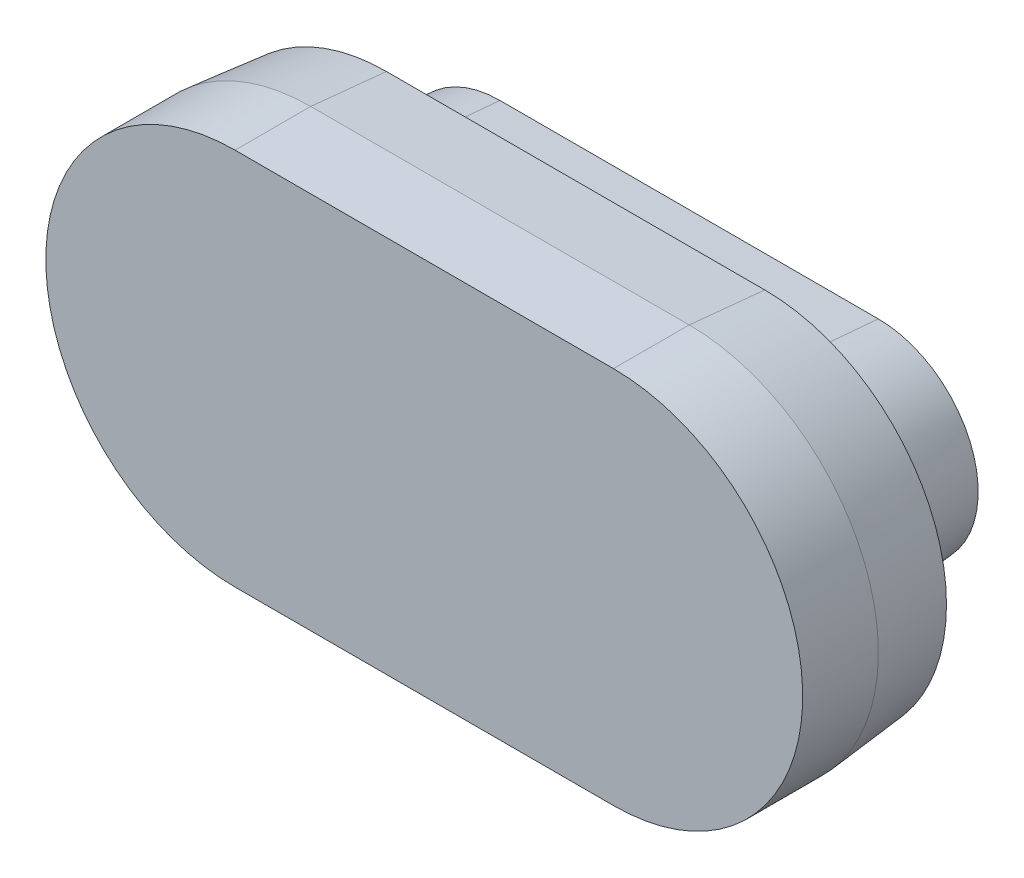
ISO-10303-21;
HEADER;
FILE_DESCRIPTION(('STEP AP214'),'2;1');
FILE_NAME('part.step','',(''),(''),'','','');
FILE_SCHEMA(('AUTOMOTIVE_DESIGN { 1 0 10303 214 1 1 1 1 }'));
ENDSEC;
DATA;
#1=APPLICATION_CONTEXT('core data for automotive mechanical design processes');
#2=APPLICATION_PROTOCOL_DEFINITION('international standard','automotive_design',2000,#1);
#3=PRODUCT_CONTEXT('',#1,'mechanical');
#4=PRODUCT('Part','Part','',(#3));
#5=PRODUCT_RELATED_PRODUCT_CATEGORY('part','',(#4));
#6=PRODUCT_DEFINITION_FORMATION('','',#4);
#7=PRODUCT_DEFINITION_CONTEXT('part definition',#1,'design');
#8=PRODUCT_DEFINITION('design','',#6,#7);
#9=PRODUCT_DEFINITION_SHAPE('','',#8);
#10=(LENGTH_UNIT() NAMED_UNIT(*) SI_UNIT(.MILLI.,.METRE.));
#11=(NAMED_UNIT(*) PLANE_ANGLE_UNIT() SI_UNIT($,.RADIAN.));
#12=(NAMED_UNIT(*) SI_UNIT($,.STERADIAN.) SOLID_ANGLE_UNIT());
#13=UNCERTAINTY_MEASURE_WITH_UNIT(LENGTH_MEASURE(1.E-05),#10,'distance_accuracy_value','');
#14=(GEOMETRIC_REPRESENTATION_CONTEXT(3) GLOBAL_UNCERTAINTY_ASSIGNED_CONTEXT((#13)) GLOBAL_UNIT_ASSIGNED_CONTEXT((#10,
#11,#12)) REPRESENTATION_CONTEXT('',''));
#15=CARTESIAN_POINT('',(0.,0.,0.));
#16=DIRECTION('',(0.,0.,1.));
#17=DIRECTION('',(1.,0.,0.));
#18=AXIS2_PLACEMENT_3D('',#15,#16,#17);
#19=CARTESIAN_POINT('',(0.,0.,0.));
#20=DIRECTION('',(0.,0.,1.));
#21=DIRECTION('',(1.,0.,0.));
#22=AXIS2_PLACEMENT_3D('',#19,#20,#21);
#23=PLANE('',#22);
#24=DIRECTION('',(-1.,0.,0.));
#25=VECTOR('',#24,1.);
#26=CARTESIAN_POINT('',(0.,-2.40000000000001,0.));
#27=LINE('',#26,#25);
#28=CARTESIAN_POINT('',(5.,-2.40000000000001,0.));
#29=VERTEX_POINT('',#28);
#30=CARTESIAN_POINT('',(0.,-2.40000000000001,0.));
#31=VERTEX_POINT('',#30);
#32=EDGE_CURVE('E297',#29,#31,#27,.T.);
#33=ORIENTED_EDGE('',*,*,#32,.T.);
#34=CARTESIAN_POINT('',(0.,0.,0.));
#35=DIRECTION('',(0.,0.,1.));
#36=DIRECTION('',(1.,0.,0.));
#37=AXIS2_PLACEMENT_3D('',#34,#35,#36);
#38=CIRCLE('',#37,2.40000000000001);
#39=CARTESIAN_POINT('',(0.,2.40000000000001,0.));
#40=VERTEX_POINT('',#39);
#41=EDGE_CURVE('E300',#31,#40,#38,.F.);
#42=ORIENTED_EDGE('',*,*,#41,.T.);
#43=DIRECTION('',(1.,0.,0.));
#44=VECTOR('',#43,1.);
#45=CARTESIAN_POINT('',(0.,2.40000000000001,0.));
#46=LINE('',#45,#44);
#47=CARTESIAN_POINT('',(5.,2.40000000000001,0.));
#48=VERTEX_POINT('',#47);
#49=EDGE_CURVE('E294',#40,#48,#46,.T.);
#50=ORIENTED_EDGE('',*,*,#49,.T.);
#51=CARTESIAN_POINT('',(5.,0.,0.));
#52=DIRECTION('',(0.,0.,1.));
#53=DIRECTION('',(1.,0.,0.));
#54=AXIS2_PLACEMENT_3D('',#51,#52,#53);
#55=CIRCLE('',#54,2.40000000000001);
#56=EDGE_CURVE('E291',#48,#29,#55,.F.);
#57=ORIENTED_EDGE('',*,*,#56,.T.);
#58=EDGE_LOOP('',(#33,#42,#50,#57));
#59=FACE_BOUND('',#58,.T.);
#60=CARTESIAN_POINT('',(5.,0.,0.));
#61=DIRECTION('',(0.,0.,-1.));
#62=DIRECTION('',(-1.,0.,0.));
#63=AXIS2_PLACEMENT_3D('',#60,#61,#62);
#64=CIRCLE('',#63,1.45);
#65=CARTESIAN_POINT('',(5.,1.45,0.));
#66=VERTEX_POINT('',#65);
#67=CARTESIAN_POINT('',(5.,-1.45,0.));
#68=VERTEX_POINT('',#67);
#69=EDGE_CURVE('E191',#66,#68,#64,.T.);
#70=ORIENTED_EDGE('',*,*,#69,.F.);
#71=DIRECTION('',(1.,0.,0.));
#72=VECTOR('',#71,1.);
#73=CARTESIAN_POINT('',(5.,1.45,0.));
#74=LINE('',#73,#72);
#75=CARTESIAN_POINT('',(0.,1.45,0.));
#76=VERTEX_POINT('',#75);
#77=EDGE_CURVE('E175',#76,#66,#74,.T.);
#78=ORIENTED_EDGE('',*,*,#77,.F.);
#79=CARTESIAN_POINT('',(0.,0.,0.));
#80=DIRECTION('',(0.,0.,-1.));
#81=DIRECTION('',(1.,0.,0.));
#82=AXIS2_PLACEMENT_3D('',#79,#80,#81);
#83=CIRCLE('',#82,1.45);
#84=CARTESIAN_POINT('',(0.,-1.45,0.));
#85=VERTEX_POINT('',#84);
#86=EDGE_CURVE('E170',#85,#76,#83,.T.);
#87=ORIENTED_EDGE('',*,*,#86,.F.);
#88=DIRECTION('',(-1.,0.,0.));
#89=VECTOR('',#88,1.);
#90=CARTESIAN_POINT('',(5.,-1.45,0.));
#91=LINE('',#90,#89);
#92=EDGE_CURVE('E172',#68,#85,#91,.T.);
#93=ORIENTED_EDGE('',*,*,#92,.F.);
#94=EDGE_LOOP('',(#70,#78,#87,#93));
#95=FACE_BOUND('',#94,.T.);
#96=ADVANCED_FACE('F53',(#59,#95),#23,.F.);
#97=CARTESIAN_POINT('',(0.,0.,2.));
#98=DIRECTION('',(0.,0.,-1.));
#99=DIRECTION('',(-1.,0.,0.));
#100=AXIS2_PLACEMENT_3D('',#97,#98,#99);
#101=CYLINDRICAL_SURFACE('',#100,2.5);
#102=DIRECTION('',(0.,0.,-1.));
#103=VECTOR('',#102,1.);
#104=CARTESIAN_POINT('',(0.,2.5,2.));
#105=LINE('',#104,#103);
#106=CARTESIAN_POINT('',(0.,2.5,2.));
#107=VERTEX_POINT('',#106);
#108=CARTESIAN_POINT('',(0.,2.5,0.999999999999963));
#109=VERTEX_POINT('',#108);
#110=EDGE_CURVE('E342',#107,#109,#105,.T.);
#111=ORIENTED_EDGE('',*,*,#110,.T.);
#112=CARTESIAN_POINT('',(0.,0.,0.999999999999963));
#113=DIRECTION('',(0.,0.,1.));
#114=DIRECTION('',(1.,0.,0.));
#115=AXIS2_PLACEMENT_3D('',#112,#113,#114);
#116=CIRCLE('',#115,2.5);
#117=CARTESIAN_POINT('',(0.,-2.5,0.999999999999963));
#118=VERTEX_POINT('',#117);
#119=EDGE_CURVE('E274',#109,#118,#116,.T.);
#120=ORIENTED_EDGE('',*,*,#119,.T.);
#121=DIRECTION('',(0.,0.,-1.));
#122=VECTOR('',#121,1.);
#123=CARTESIAN_POINT('',(0.,-2.5,2.));
#124=LINE('',#123,#122);
#125=CARTESIAN_POINT('',(0.,-2.5,2.));
#126=VERTEX_POINT('',#125);
#127=EDGE_CURVE('E222',#126,#118,#124,.T.);
#128=ORIENTED_EDGE('',*,*,#127,.F.);
#129=CARTESIAN_POINT('',(0.,0.,2.));
#130=DIRECTION('',(0.,0.,1.));
#131=DIRECTION('',(1.,0.,0.));
#132=AXIS2_PLACEMENT_3D('',#129,#130,#131);
#133=CIRCLE('',#132,2.5);
#134=EDGE_CURVE('E200',#107,#126,#133,.T.);
#135=ORIENTED_EDGE('',*,*,#134,.F.);
#136=EDGE_LOOP('',(#111,#120,#128,#135));
#137=FACE_BOUND('',#136,.T.);
#138=ADVANCED_FACE('F339',(#137),#101,.T.);
#139=CARTESIAN_POINT('',(0.,-2.5,2.));
#140=DIRECTION('',(0.,1.,0.));
#141=DIRECTION('',(0.,0.,1.));
#142=AXIS2_PLACEMENT_3D('',#139,#140,#141);
#143=PLANE('',#142);
#144=ORIENTED_EDGE('',*,*,#127,.T.);
#145=DIRECTION('',(1.,0.,0.));
#146=VECTOR('',#145,1.);
#147=CARTESIAN_POINT('',(0.,-2.5,0.999999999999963));
#148=LINE('',#147,#146);
#149=CARTESIAN_POINT('',(5.,-2.5,0.999999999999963));
#150=VERTEX_POINT('',#149);
#151=EDGE_CURVE('E78',#118,#150,#148,.T.);
#152=ORIENTED_EDGE('',*,*,#151,.T.);
#153=DIRECTION('',(0.,0.,-1.));
#154=VECTOR('',#153,1.);
#155=CARTESIAN_POINT('',(5.,-2.5,2.));
#156=LINE('',#155,#154);
#157=CARTESIAN_POINT('',(5.,-2.5,2.));
#158=VERTEX_POINT('',#157);
#159=EDGE_CURVE('E347',#158,#150,#156,.T.);
#160=ORIENTED_EDGE('',*,*,#159,.F.);
#161=DIRECTION('',(1.,0.,0.));
#162=VECTOR('',#161,1.);
#163=CARTESIAN_POINT('',(0.,-2.5,2.));
#164=LINE('',#163,#162);
#165=EDGE_CURVE('E344',#126,#158,#164,.T.);
#166=ORIENTED_EDGE('',*,*,#165,.F.);
#167=EDGE_LOOP('',(#144,#152,#160,#166));
#168=FACE_BOUND('',#167,.T.);
#169=ADVANCED_FACE('F343',(#168),#143,.F.);
#170=CARTESIAN_POINT('',(5.,0.,2.));
#171=DIRECTION('',(0.,0.,-1.));
#172=DIRECTION('',(-1.,0.,0.));
#173=AXIS2_PLACEMENT_3D('',#170,#171,#172);
#174=CYLINDRICAL_SURFACE('',#173,2.5);
#175=ORIENTED_EDGE('',*,*,#159,.T.);
#176=CARTESIAN_POINT('',(5.,0.,0.999999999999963));
#177=DIRECTION('',(0.,0.,1.));
#178=DIRECTION('',(1.,0.,0.));
#179=AXIS2_PLACEMENT_3D('',#176,#177,#178);
#180=CIRCLE('',#179,2.5);
#181=CARTESIAN_POINT('',(5.,2.5,0.999999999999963));
#182=VERTEX_POINT('',#181);
#183=EDGE_CURVE('E11',#150,#182,#180,.T.);
#184=ORIENTED_EDGE('',*,*,#183,.T.);
#185=DIRECTION('',(0.,0.,-1.));
#186=VECTOR('',#185,1.);
#187=CARTESIAN_POINT('',(5.,2.5,2.));
#188=LINE('',#187,#186);
#189=CARTESIAN_POINT('',(5.,2.5,2.));
#190=VERTEX_POINT('',#189);
#191=EDGE_CURVE('E350',#190,#182,#188,.T.);
#192=ORIENTED_EDGE('',*,*,#191,.F.);
#193=CARTESIAN_POINT('',(5.,0.,2.));
#194=DIRECTION('',(0.,0.,1.));
#195=DIRECTION('',(1.,0.,0.));
#196=AXIS2_PLACEMENT_3D('',#193,#194,#195);
#197=CIRCLE('',#196,2.5);
#198=EDGE_CURVE('E372',#158,#190,#197,.T.);
#199=ORIENTED_EDGE('',*,*,#198,.F.);
#200=EDGE_LOOP('',(#175,#184,#192,#199));
#201=FACE_BOUND('',#200,.T.);
#202=ADVANCED_FACE('F384',(#201),#174,.T.);
#203=CARTESIAN_POINT('',(0.,2.5,2.));
#204=DIRECTION('',(0.,-1.,0.));
#205=DIRECTION('',(0.,0.,-1.));
#206=AXIS2_PLACEMENT_3D('',#203,#204,#205);
#207=PLANE('',#206);
#208=ORIENTED_EDGE('',*,*,#191,.T.);
#209=DIRECTION('',(-1.,0.,0.));
#210=VECTOR('',#209,1.);
#211=CARTESIAN_POINT('',(0.,2.5,0.999999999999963));
#212=LINE('',#211,#210);
#213=EDGE_CURVE('E64',#182,#109,#212,.T.);
#214=ORIENTED_EDGE('',*,*,#213,.T.);
#215=ORIENTED_EDGE('',*,*,#110,.F.);
#216=DIRECTION('',(-1.,0.,0.));
#217=VECTOR('',#216,1.);
#218=CARTESIAN_POINT('',(0.,2.5,2.));
#219=LINE('',#218,#217);
#220=EDGE_CURVE('E375',#190,#107,#219,.T.);
#221=ORIENTED_EDGE('',*,*,#220,.F.);
#222=EDGE_LOOP('',(#208,#214,#215,#221));
#223=FACE_BOUND('',#222,.T.);
#224=ADVANCED_FACE('F382',(#223),#207,.F.);
#225=CARTESIAN_POINT('',(0.,0.,2.));
#226=DIRECTION('',(0.,0.,1.));
#227=DIRECTION('',(1.,0.,0.));
#228=AXIS2_PLACEMENT_3D('',#225,#226,#227);
#229=PLANE('',#228);
#230=ORIENTED_EDGE('',*,*,#134,.T.);
#231=ORIENTED_EDGE('',*,*,#165,.T.);
#232=ORIENTED_EDGE('',*,*,#198,.T.);
#233=ORIENTED_EDGE('',*,*,#220,.T.);
#234=EDGE_LOOP('',(#230,#231,#232,#233));
#235=FACE_BOUND('',#234,.T.);
#236=ADVANCED_FACE('F386',(#235),#229,.T.);
#237=CARTESIAN_POINT('',(5.,0.,0.));
#238=DIRECTION('',(0.,0.,1.));
#239=DIRECTION('',(-1.,0.,0.));
#240=AXIS2_PLACEMENT_3D('',#237,#238,#239);
#241=CONICAL_SURFACE('',#240,1.45,0.0872664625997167);
#242=ORIENTED_EDGE('',*,*,#69,.T.);
#243=DIRECTION('',(0.,-0.0871557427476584,0.996194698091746));
#244=VECTOR('',#243,1.);
#245=CARTESIAN_POINT('',(5.,-1.43898562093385,-0.125894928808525));
#246=LINE('',#245,#244);
#247=CARTESIAN_POINT('',(5.,-1.31876700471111,-1.5));
#248=VERTEX_POINT('',#247);
#249=EDGE_CURVE('E188',#248,#68,#246,.T.);
#250=ORIENTED_EDGE('',*,*,#249,.F.);
#251=CARTESIAN_POINT('',(5.,0.,-1.5));
#252=DIRECTION('',(0.,0.,-1.));
#253=DIRECTION('',(-1.,0.,0.));
#254=AXIS2_PLACEMENT_3D('',#251,#252,#253);
#255=CIRCLE('',#254,1.31876700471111);
#256=CARTESIAN_POINT('',(5.,1.31876700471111,-1.5));
#257=VERTEX_POINT('',#256);
#258=EDGE_CURVE('E214',#257,#248,#255,.T.);
#259=ORIENTED_EDGE('',*,*,#258,.F.);
#260=DIRECTION('',(0.,0.0871557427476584,0.996194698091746));
#261=VECTOR('',#260,1.);
#262=CARTESIAN_POINT('',(5.,1.43898562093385,-0.125894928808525));
#263=LINE('',#262,#261);
#264=EDGE_CURVE('E202',#257,#66,#263,.T.);
#265=ORIENTED_EDGE('',*,*,#264,.T.);
#266=EDGE_LOOP('',(#242,#250,#259,#265));
#267=FACE_BOUND('',#266,.T.);
#268=ADVANCED_FACE('F362',(#267),#241,.T.);
#269=CARTESIAN_POINT('',(5.,-1.45,0.));
#270=DIRECTION('',(0.,-0.996194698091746,-0.0871557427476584));
#271=DIRECTION('',(0.,0.0871557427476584,-0.996194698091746));
#272=AXIS2_PLACEMENT_3D('',#269,#270,#271);
#273=PLANE('',#272);
#274=ORIENTED_EDGE('',*,*,#92,.T.);
#275=DIRECTION('',(0.,-0.0871557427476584,0.996194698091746));
#276=VECTOR('',#275,1.);
#277=CARTESIAN_POINT('',(0.,-1.43898562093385,-0.125894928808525));
#278=LINE('',#277,#276);
#279=CARTESIAN_POINT('',(0.,-1.31876700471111,-1.5));
#280=VERTEX_POINT('',#279);
#281=EDGE_CURVE('E185',#280,#85,#278,.T.);
#282=ORIENTED_EDGE('',*,*,#281,.F.);
#283=DIRECTION('',(1.,0.,0.));
#284=VECTOR('',#283,1.);
#285=CARTESIAN_POINT('',(5.,-1.31876700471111,-1.5));
#286=LINE('',#285,#284);
#287=EDGE_CURVE('E206',#248,#280,#286,.F.);
#288=ORIENTED_EDGE('',*,*,#287,.F.);
#289=ORIENTED_EDGE('',*,*,#249,.T.);
#290=EDGE_LOOP('',(#274,#282,#288,#289));
#291=FACE_BOUND('',#290,.T.);
#292=ADVANCED_FACE('F184',(#291),#273,.T.);
#293=CARTESIAN_POINT('',(0.,0.,0.));
#294=DIRECTION('',(0.,0.,1.));
#295=DIRECTION('',(1.,0.,0.));
#296=AXIS2_PLACEMENT_3D('',#293,#294,#295);
#297=CONICAL_SURFACE('',#296,1.45,0.0872664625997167);
#298=ORIENTED_EDGE('',*,*,#86,.T.);
#299=DIRECTION('',(0.,0.0871557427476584,0.996194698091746));
#300=VECTOR('',#299,1.);
#301=CARTESIAN_POINT('',(0.,1.43898562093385,-0.125894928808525));
#302=LINE('',#301,#300);
#303=CARTESIAN_POINT('',(0.,1.31876700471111,-1.5));
#304=VERTEX_POINT('',#303);
#305=EDGE_CURVE('E196',#304,#76,#302,.T.);
#306=ORIENTED_EDGE('',*,*,#305,.F.);
#307=CARTESIAN_POINT('',(0.,0.,-1.5));
#308=DIRECTION('',(0.,0.,-1.));
#309=DIRECTION('',(-1.,0.,0.));
#310=AXIS2_PLACEMENT_3D('',#307,#308,#309);
#311=CIRCLE('',#310,1.31876700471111);
#312=EDGE_CURVE('E194',#280,#304,#311,.T.);
#313=ORIENTED_EDGE('',*,*,#312,.F.);
#314=ORIENTED_EDGE('',*,*,#281,.T.);
#315=EDGE_LOOP('',(#298,#306,#313,#314));
#316=FACE_BOUND('',#315,.T.);
#317=ADVANCED_FACE('F193',(#316),#297,.T.);
#318=CARTESIAN_POINT('',(5.,1.45,0.));
#319=DIRECTION('',(0.,0.996194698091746,-0.0871557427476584));
#320=DIRECTION('',(0.,0.0871557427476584,0.996194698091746));
#321=AXIS2_PLACEMENT_3D('',#318,#319,#320);
#322=PLANE('',#321);
#323=ORIENTED_EDGE('',*,*,#77,.T.);
#324=ORIENTED_EDGE('',*,*,#264,.F.);
#325=DIRECTION('',(-1.,0.,0.));
#326=VECTOR('',#325,1.);
#327=CARTESIAN_POINT('',(5.,1.31876700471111,-1.5));
#328=LINE('',#327,#326);
#329=EDGE_CURVE('E209',#304,#257,#328,.F.);
#330=ORIENTED_EDGE('',*,*,#329,.F.);
#331=ORIENTED_EDGE('',*,*,#305,.T.);
#332=EDGE_LOOP('',(#323,#324,#330,#331));
#333=FACE_BOUND('',#332,.T.);
#334=ADVANCED_FACE('F360',(#333),#322,.T.);
#335=CARTESIAN_POINT('',(5.,0.,-1.5));
#336=DIRECTION('',(0.,0.,-1.));
#337=DIRECTION('',(-1.,0.,0.));
#338=AXIS2_PLACEMENT_3D('',#335,#336,#337);
#339=PLANE('',#338);
#340=CARTESIAN_POINT('',(0.,0.,-1.5));
#341=DIRECTION('',(0.,0.,-1.));
#342=DIRECTION('',(-1.,0.,0.));
#343=AXIS2_PLACEMENT_3D('',#340,#341,#342);
#344=CIRCLE('',#343,0.918767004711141);
#345=CARTESIAN_POINT('',(0.,0.918767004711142,-1.5));
#346=VERTEX_POINT('',#345);
#347=CARTESIAN_POINT('',(0.,-0.91876700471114,-1.5));
#348=VERTEX_POINT('',#347);
#349=EDGE_CURVE('E226',#346,#348,#344,.F.);
#350=ORIENTED_EDGE('',*,*,#349,.T.);
#351=DIRECTION('',(1.,0.,0.));
#352=VECTOR('',#351,1.);
#353=CARTESIAN_POINT('',(5.,-0.918767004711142,-1.5));
#354=LINE('',#353,#352);
#355=CARTESIAN_POINT('',(5.,-0.918767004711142,-1.5));
#356=VERTEX_POINT('',#355);
#357=EDGE_CURVE('E229',#348,#356,#354,.T.);
#358=ORIENTED_EDGE('',*,*,#357,.T.);
#359=CARTESIAN_POINT('',(5.,0.,-1.5));
#360=DIRECTION('',(0.,0.,-1.));
#361=DIRECTION('',(-1.,0.,0.));
#362=AXIS2_PLACEMENT_3D('',#359,#360,#361);
#363=CIRCLE('',#362,0.918767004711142);
#364=CARTESIAN_POINT('',(5.,0.918767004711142,-1.5));
#365=VERTEX_POINT('',#364);
#366=EDGE_CURVE('E221',#356,#365,#363,.F.);
#367=ORIENTED_EDGE('',*,*,#366,.T.);
#368=DIRECTION('',(-1.,0.,0.));
#369=VECTOR('',#368,1.);
#370=CARTESIAN_POINT('',(0.,0.918767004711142,-1.5));
#371=LINE('',#370,#369);
#372=EDGE_CURVE('E218',#365,#346,#371,.T.);
#373=ORIENTED_EDGE('',*,*,#372,.T.);
#374=EDGE_LOOP('',(#350,#358,#367,#373));
#375=FACE_BOUND('',#374,.T.);
#376=ORIENTED_EDGE('',*,*,#258,.T.);
#377=ORIENTED_EDGE('',*,*,#287,.T.);
#378=ORIENTED_EDGE('',*,*,#312,.T.);
#379=ORIENTED_EDGE('',*,*,#329,.T.);
#380=EDGE_LOOP('',(#376,#377,#378,#379));
#381=FACE_BOUND('',#380,.T.);
#382=ADVANCED_FACE('F357',(#375,#381),#339,.T.);
#383=CARTESIAN_POINT('',(5.,0.,1.));
#384=DIRECTION('',(0.,0.,-1.));
#385=DIRECTION('',(-1.,0.,0.));
#386=AXIS2_PLACEMENT_3D('',#383,#384,#385);
#387=PLANE('',#386);
#388=CARTESIAN_POINT('',(0.,0.,1.));
#389=DIRECTION('',(0.,0.,-1.));
#390=DIRECTION('',(-1.,0.,0.));
#391=AXIS2_PLACEMENT_3D('',#388,#389,#390);
#392=CIRCLE('',#391,0.216273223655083);
#393=CARTESIAN_POINT('',(0.,-0.216273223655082,1.));
#394=VERTEX_POINT('',#393);
#395=CARTESIAN_POINT('',(0.,0.216273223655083,1.));
#396=VERTEX_POINT('',#395);
#397=EDGE_CURVE('E254',#394,#396,#392,.T.);
#398=ORIENTED_EDGE('',*,*,#397,.T.);
#399=DIRECTION('',(1.,0.,0.));
#400=VECTOR('',#399,1.);
#401=CARTESIAN_POINT('',(5.,0.216273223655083,1.));
#402=LINE('',#401,#400);
#403=CARTESIAN_POINT('',(5.,0.216273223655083,1.));
#404=VERTEX_POINT('',#403);
#405=EDGE_CURVE('E257',#396,#404,#402,.T.);
#406=ORIENTED_EDGE('',*,*,#405,.T.);
#407=CARTESIAN_POINT('',(5.,0.,1.));
#408=DIRECTION('',(0.,0.,-1.));
#409=DIRECTION('',(-1.,0.,0.));
#410=AXIS2_PLACEMENT_3D('',#407,#408,#409);
#411=CIRCLE('',#410,0.216273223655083);
#412=CARTESIAN_POINT('',(5.,-0.216273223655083,1.));
#413=VERTEX_POINT('',#412);
#414=EDGE_CURVE('E233',#404,#413,#411,.T.);
#415=ORIENTED_EDGE('',*,*,#414,.T.);
#416=DIRECTION('',(-1.,0.,0.));
#417=VECTOR('',#416,1.);
#418=CARTESIAN_POINT('',(0.,-0.216273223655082,1.));
#419=LINE('',#418,#417);
#420=EDGE_CURVE('E251',#413,#394,#419,.T.);
#421=ORIENTED_EDGE('',*,*,#420,.T.);
#422=EDGE_LOOP('',(#398,#406,#415,#421));
#423=FACE_BOUND('',#422,.T.);
#424=ADVANCED_FACE('F441',(#423),#387,.T.);
#425=CARTESIAN_POINT('',(0.,0.518767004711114,2.5));
#426=DIRECTION('',(0.,-0.995037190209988,-0.0995037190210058));
#427=DIRECTION('',(-1.,0.,0.));
#428=AXIS2_PLACEMENT_3D('',#425,#426,#427);
#429=PLANE('',#428);
#430=DIRECTION('',(0.,0.0995037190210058,-0.995037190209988));
#431=VECTOR('',#430,1.);
#432=CARTESIAN_POINT('',(5.,0.518767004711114,2.5));
#433=LINE('',#432,#431);
#434=CARTESIAN_POINT('',(5.,0.713791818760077,0.549751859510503));
#435=VERTEX_POINT('',#434);
#436=EDGE_CURVE('E246',#435,#365,#433,.T.);
#437=ORIENTED_EDGE('',*,*,#436,.F.);
#438=DIRECTION('',(1.,0.,0.));
#439=VECTOR('',#438,1.);
#440=CARTESIAN_POINT('',(0.,0.713791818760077,0.549751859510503));
#441=LINE('',#440,#439);
#442=CARTESIAN_POINT('',(0.,0.713791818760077,0.549751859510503));
#443=VERTEX_POINT('',#442);
#444=EDGE_CURVE('E261',#435,#443,#441,.F.);
#445=ORIENTED_EDGE('',*,*,#444,.T.);
#446=DIRECTION('',(0.,-0.0995037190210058,0.995037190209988));
#447=VECTOR('',#446,1.);
#448=CARTESIAN_POINT('',(0.,0.918767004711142,-1.5));
#449=LINE('',#448,#447);
#450=EDGE_CURVE('E242',#346,#443,#449,.T.);
#451=ORIENTED_EDGE('',*,*,#450,.F.);
#452=ORIENTED_EDGE('',*,*,#372,.F.);
#453=EDGE_LOOP('',(#437,#445,#451,#452));
#454=FACE_BOUND('',#453,.T.);
#455=ADVANCED_FACE('F435',(#454),#429,.T.);
#456=CARTESIAN_POINT('',(5.,0.,2.5));
#457=DIRECTION('',(0.,0.,-1.));
#458=DIRECTION('',(-1.,0.,0.));
#459=AXIS2_PLACEMENT_3D('',#456,#457,#458);
#460=CONICAL_SURFACE('',#459,0.518767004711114,0.099668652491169);
#461=DIRECTION('',(0.,-0.0995037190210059,-0.995037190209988));
#462=VECTOR('',#461,1.);
#463=CARTESIAN_POINT('',(5.,-0.518767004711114,2.5));
#464=LINE('',#463,#462);
#465=CARTESIAN_POINT('',(5.,-0.713791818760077,0.549751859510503));
#466=VERTEX_POINT('',#465);
#467=EDGE_CURVE('E238',#466,#356,#464,.T.);
#468=ORIENTED_EDGE('',*,*,#467,.F.);
#469=CARTESIAN_POINT('',(5.,0.,0.549751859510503));
#470=DIRECTION('',(0.,0.,-1.));
#471=DIRECTION('',(-1.,0.,0.));
#472=AXIS2_PLACEMENT_3D('',#469,#470,#471);
#473=CIRCLE('',#472,0.713791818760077);
#474=EDGE_CURVE('E271',#466,#435,#473,.F.);
#475=ORIENTED_EDGE('',*,*,#474,.T.);
#476=ORIENTED_EDGE('',*,*,#436,.T.);
#477=ORIENTED_EDGE('',*,*,#366,.F.);
#478=EDGE_LOOP('',(#468,#475,#476,#477));
#479=FACE_BOUND('',#478,.T.);
#480=ADVANCED_FACE('F428',(#479),#460,.F.);
#481=CARTESIAN_POINT('',(0.,0.,2.5));
#482=DIRECTION('',(0.,0.,-1.));
#483=DIRECTION('',(-1.,0.,0.));
#484=AXIS2_PLACEMENT_3D('',#481,#482,#483);
#485=CONICAL_SURFACE('',#484,0.518767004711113,0.099668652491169);
#486=ORIENTED_EDGE('',*,*,#450,.T.);
#487=CARTESIAN_POINT('',(0.,0.,0.549751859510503));
#488=DIRECTION('',(0.,0.,-1.));
#489=DIRECTION('',(-1.,0.,0.));
#490=AXIS2_PLACEMENT_3D('',#487,#488,#489);
#491=CIRCLE('',#490,0.713791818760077);
#492=CARTESIAN_POINT('',(0.,-0.713791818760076,0.549751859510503));
#493=VERTEX_POINT('',#492);
#494=EDGE_CURVE('E265',#443,#493,#491,.F.);
#495=ORIENTED_EDGE('',*,*,#494,.T.);
#496=DIRECTION('',(0.,0.0995037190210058,0.995037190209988));
#497=VECTOR('',#496,1.);
#498=CARTESIAN_POINT('',(0.,-0.91876700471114,-1.5));
#499=LINE('',#498,#497);
#500=EDGE_CURVE('E234',#348,#493,#499,.T.);
#501=ORIENTED_EDGE('',*,*,#500,.F.);
#502=ORIENTED_EDGE('',*,*,#349,.F.);
#503=EDGE_LOOP('',(#486,#495,#501,#502));
#504=FACE_BOUND('',#503,.T.);
#505=ADVANCED_FACE('F421',(#504),#485,.F.);
#506=CARTESIAN_POINT('',(5.,-0.518767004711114,2.5));
#507=DIRECTION('',(0.,0.995037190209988,-0.0995037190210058));
#508=DIRECTION('',(1.,0.,0.));
#509=AXIS2_PLACEMENT_3D('',#506,#507,#508);
#510=PLANE('',#509);
#511=ORIENTED_EDGE('',*,*,#500,.T.);
#512=DIRECTION('',(-1.,0.,0.));
#513=VECTOR('',#512,1.);
#514=CARTESIAN_POINT('',(5.,-0.713791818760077,0.549751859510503));
#515=LINE('',#514,#513);
#516=EDGE_CURVE('E268',#493,#466,#515,.F.);
#517=ORIENTED_EDGE('',*,*,#516,.T.);
#518=ORIENTED_EDGE('',*,*,#467,.T.);
#519=ORIENTED_EDGE('',*,*,#357,.F.);
#520=EDGE_LOOP('',(#511,#517,#518,#519));
#521=FACE_BOUND('',#520,.T.);
#522=ADVANCED_FACE('F414',(#521),#510,.T.);
#523=CARTESIAN_POINT('',(5.,-0.216273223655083,0.5));
#524=DIRECTION('',(1.,0.,0.));
#525=DIRECTION('',(0.,1.,0.));
#526=AXIS2_PLACEMENT_3D('',#523,#524,#525);
#527=CYLINDRICAL_SURFACE('',#526,0.5);
#528=CARTESIAN_POINT('',(5.,-0.216273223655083,0.5));
#529=DIRECTION('',(-1.,0.,0.));
#530=DIRECTION('',(0.,0.,1.));
#531=AXIS2_PLACEMENT_3D('',#528,#529,#530);
#532=CIRCLE('',#531,0.5);
#533=EDGE_CURVE('E281',#466,#413,#532,.T.);
#534=ORIENTED_EDGE('',*,*,#533,.F.);
#535=ORIENTED_EDGE('',*,*,#516,.F.);
#536=CARTESIAN_POINT('',(0.,-0.216273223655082,0.5));
#537=DIRECTION('',(1.,0.,0.));
#538=DIRECTION('',(0.,1.,0.));
#539=AXIS2_PLACEMENT_3D('',#536,#537,#538);
#540=CIRCLE('',#539,0.5);
#541=EDGE_CURVE('E239',#394,#493,#540,.T.);
#542=ORIENTED_EDGE('',*,*,#541,.F.);
#543=ORIENTED_EDGE('',*,*,#420,.F.);
#544=EDGE_LOOP('',(#534,#535,#542,#543));
#545=FACE_BOUND('',#544,.T.);
#546=ADVANCED_FACE('F420',(#545),#527,.F.);
#547=CARTESIAN_POINT('',(0.,0.,0.5));
#548=DIRECTION('',(0.,0.,-1.));
#549=DIRECTION('',(-1.,0.,0.));
#550=AXIS2_PLACEMENT_3D('',#547,#548,#549);
#551=DEGENERATE_TOROIDAL_SURFACE('',#550,0.216273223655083,0.5,.T.);
#552=ORIENTED_EDGE('',*,*,#541,.T.);
#553=ORIENTED_EDGE('',*,*,#494,.F.);
#554=CARTESIAN_POINT('',(0.,0.216273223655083,0.5));
#555=DIRECTION('',(-1.,0.,0.));
#556=DIRECTION('',(0.,-1.,0.));
#557=AXIS2_PLACEMENT_3D('',#554,#555,#556);
#558=CIRCLE('',#557,0.5);
#559=EDGE_CURVE('E278',#396,#443,#558,.T.);
#560=ORIENTED_EDGE('',*,*,#559,.F.);
#561=ORIENTED_EDGE('',*,*,#397,.F.);
#562=EDGE_LOOP('',(#552,#553,#560,#561));
#563=FACE_BOUND('',#562,.T.);
#564=ADVANCED_FACE('F450',(#563),#551,.F.);
#565=CARTESIAN_POINT('',(5.,0.,0.5));
#566=DIRECTION('',(0.,0.,-1.));
#567=DIRECTION('',(-1.,0.,0.));
#568=AXIS2_PLACEMENT_3D('',#565,#566,#567);
#569=DEGENERATE_TOROIDAL_SURFACE('',#568,0.216273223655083,0.5,.T.);
#570=ORIENTED_EDGE('',*,*,#533,.T.);
#571=ORIENTED_EDGE('',*,*,#414,.F.);
#572=CARTESIAN_POINT('',(5.,0.216273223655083,0.5));
#573=DIRECTION('',(1.,0.,0.));
#574=DIRECTION('',(0.,0.,-1.));
#575=AXIS2_PLACEMENT_3D('',#572,#573,#574);
#576=CIRCLE('',#575,0.5);
#577=EDGE_CURVE('E275',#435,#404,#576,.T.);
#578=ORIENTED_EDGE('',*,*,#577,.F.);
#579=ORIENTED_EDGE('',*,*,#474,.F.);
#580=EDGE_LOOP('',(#570,#571,#578,#579));
#581=FACE_BOUND('',#580,.T.);
#582=ADVANCED_FACE('F446',(#581),#569,.F.);
#583=CARTESIAN_POINT('',(5.,0.216273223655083,0.5));
#584=DIRECTION('',(-1.,0.,0.));
#585=DIRECTION('',(0.,-1.,0.));
#586=AXIS2_PLACEMENT_3D('',#583,#584,#585);
#587=CYLINDRICAL_SURFACE('',#586,0.5);
#588=ORIENTED_EDGE('',*,*,#559,.T.);
#589=ORIENTED_EDGE('',*,*,#444,.F.);
#590=ORIENTED_EDGE('',*,*,#577,.T.);
#591=ORIENTED_EDGE('',*,*,#405,.F.);
#592=EDGE_LOOP('',(#588,#589,#590,#591));
#593=FACE_BOUND('',#592,.T.);
#594=ADVANCED_FACE('F443',(#593),#587,.F.);
#595=CARTESIAN_POINT('',(5.,0.,0.999999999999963));
#596=DIRECTION('',(0.,0.,1.));
#597=DIRECTION('',(1.,0.,0.));
#598=AXIS2_PLACEMENT_3D('',#595,#596,#597);
#599=CONICAL_SURFACE('',#598,2.5,0.0996686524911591);
#600=DIRECTION('',(0.,-0.099503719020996,0.995037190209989));
#601=VECTOR('',#600,1.);
#602=CARTESIAN_POINT('',(5.,-2.40000000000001,0.));
#603=LINE('',#602,#601);
#604=EDGE_CURVE('E313',#29,#150,#603,.T.);
#605=ORIENTED_EDGE('',*,*,#604,.F.);
#606=ORIENTED_EDGE('',*,*,#56,.F.);
#607=DIRECTION('',(0.,-0.099503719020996,-0.995037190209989));
#608=VECTOR('',#607,1.);
#609=CARTESIAN_POINT('',(5.,2.5,0.999999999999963));
#610=LINE('',#609,#608);
#611=EDGE_CURVE('E58',#182,#48,#610,.T.);
#612=ORIENTED_EDGE('',*,*,#611,.F.);
#613=ORIENTED_EDGE('',*,*,#183,.F.);
#614=EDGE_LOOP('',(#605,#606,#612,#613));
#615=FACE_BOUND('',#614,.T.);
#616=ADVANCED_FACE('F56',(#615),#599,.T.);
#617=CARTESIAN_POINT('',(0.,2.5,0.999999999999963));
#618=DIRECTION('',(0.,-0.995037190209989,0.099503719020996));
#619=DIRECTION('',(-1.,0.,0.));
#620=AXIS2_PLACEMENT_3D('',#617,#618,#619);
#621=PLANE('',#620);
#622=ORIENTED_EDGE('',*,*,#611,.T.);
#623=ORIENTED_EDGE('',*,*,#49,.F.);
#624=DIRECTION('',(0.,-0.099503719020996,-0.995037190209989));
#625=VECTOR('',#624,1.);
#626=CARTESIAN_POINT('',(0.,2.5,0.999999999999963));
#627=LINE('',#626,#625);
#628=EDGE_CURVE('E311',#109,#40,#627,.T.);
#629=ORIENTED_EDGE('',*,*,#628,.F.);
#630=ORIENTED_EDGE('',*,*,#213,.F.);
#631=EDGE_LOOP('',(#622,#623,#629,#630));
#632=FACE_BOUND('',#631,.T.);
#633=ADVANCED_FACE('F325',(#632),#621,.F.);
#634=CARTESIAN_POINT('',(0.,-2.5,0.999999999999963));
#635=DIRECTION('',(0.,0.995037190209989,0.099503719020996));
#636=DIRECTION('',(1.,0.,0.));
#637=AXIS2_PLACEMENT_3D('',#634,#635,#636);
#638=PLANE('',#637);
#639=ORIENTED_EDGE('',*,*,#604,.T.);
#640=ORIENTED_EDGE('',*,*,#151,.F.);
#641=DIRECTION('',(0.,-0.099503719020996,0.995037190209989));
#642=VECTOR('',#641,1.);
#643=CARTESIAN_POINT('',(0.,-2.40000000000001,0.));
#644=LINE('',#643,#642);
#645=EDGE_CURVE('E308',#31,#118,#644,.T.);
#646=ORIENTED_EDGE('',*,*,#645,.F.);
#647=ORIENTED_EDGE('',*,*,#32,.F.);
#648=EDGE_LOOP('',(#639,#640,#646,#647));
#649=FACE_BOUND('',#648,.T.);
#650=ADVANCED_FACE('F335',(#649),#638,.F.);
#651=CARTESIAN_POINT('',(0.,0.,0.999999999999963));
#652=DIRECTION('',(0.,0.,1.));
#653=DIRECTION('',(1.,0.,0.));
#654=AXIS2_PLACEMENT_3D('',#651,#652,#653);
#655=CONICAL_SURFACE('',#654,2.5,0.0996686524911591);
#656=ORIENTED_EDGE('',*,*,#628,.T.);
#657=ORIENTED_EDGE('',*,*,#41,.F.);
#658=ORIENTED_EDGE('',*,*,#645,.T.);
#659=ORIENTED_EDGE('',*,*,#119,.F.);
#660=EDGE_LOOP('',(#656,#657,#658,#659));
#661=FACE_BOUND('',#660,.T.);
#662=ADVANCED_FACE('F333',(#661),#655,.T.);
#663=CLOSED_SHELL('',(#96,#138,#169,#202,#224,#236,#268,#292,#317,#334,#382,#424,#455,#480,#505,
#522,#546,#564,#582,#594,#616,#633,#650,#662));
#664=MANIFOLD_SOLID_BREP('B2',#663);
#665=ADVANCED_BREP_SHAPE_REPRESENTATION('',(#18,#664),#14);
#666=SHAPE_DEFINITION_REPRESENTATION(#9,#665);
ENDSEC;
END-ISO-10303-21;
